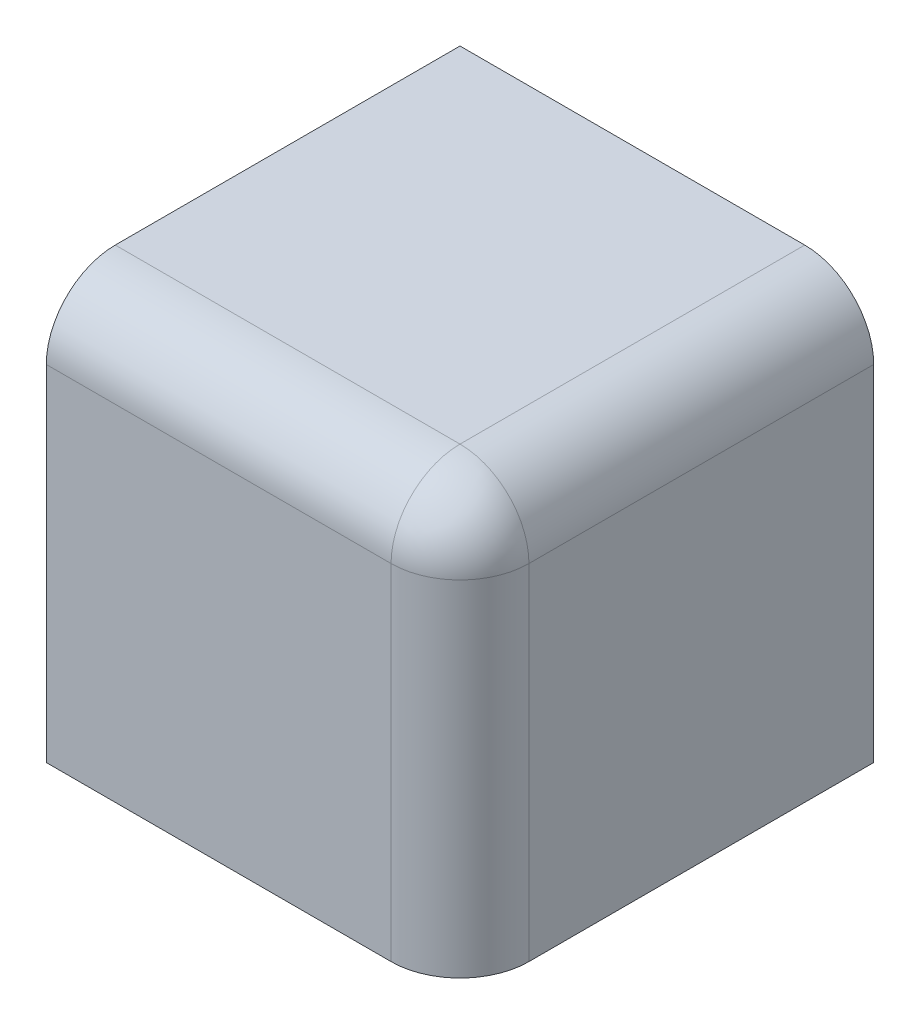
ISO-10303-21;
HEADER;
FILE_DESCRIPTION(('STEP AP214'),'2;1');
FILE_NAME('part.step','',(''),(''),'','','');
FILE_SCHEMA(('AUTOMOTIVE_DESIGN { 1 0 10303 214 1 1 1 1 }'));
ENDSEC;
DATA;
#1=APPLICATION_CONTEXT('core data for automotive mechanical design processes');
#2=APPLICATION_PROTOCOL_DEFINITION('international standard','automotive_design',2000,#1);
#3=PRODUCT_CONTEXT('',#1,'mechanical');
#4=PRODUCT('Part','Part','',(#3));
#5=PRODUCT_RELATED_PRODUCT_CATEGORY('part','',(#4));
#6=PRODUCT_DEFINITION_FORMATION('','',#4);
#7=PRODUCT_DEFINITION_CONTEXT('part definition',#1,'design');
#8=PRODUCT_DEFINITION('design','',#6,#7);
#9=PRODUCT_DEFINITION_SHAPE('','',#8);
#10=(LENGTH_UNIT() NAMED_UNIT(*) SI_UNIT(.MILLI.,.METRE.));
#11=(NAMED_UNIT(*) PLANE_ANGLE_UNIT() SI_UNIT($,.RADIAN.));
#12=(NAMED_UNIT(*) SI_UNIT($,.STERADIAN.) SOLID_ANGLE_UNIT());
#13=UNCERTAINTY_MEASURE_WITH_UNIT(LENGTH_MEASURE(1.E-05),#10,'distance_accuracy_value','');
#14=(GEOMETRIC_REPRESENTATION_CONTEXT(3) GLOBAL_UNCERTAINTY_ASSIGNED_CONTEXT((#13)) GLOBAL_UNIT_ASSIGNED_CONTEXT((#10,
#11,#12)) REPRESENTATION_CONTEXT('',''));
#15=CARTESIAN_POINT('',(0.,0.,0.));
#16=DIRECTION('',(0.,0.,1.));
#17=DIRECTION('',(1.,0.,0.));
#18=AXIS2_PLACEMENT_3D('',#15,#16,#17);
#19=CARTESIAN_POINT('',(76.2,152.4,76.2));
#20=DIRECTION('',(-1.,0.,0.));
#21=DIRECTION('',(0.,0.,1.));
#22=AXIS2_PLACEMENT_3D('',#19,#20,#21);
#23=PLANE('',#22);
#24=DIRECTION('',(0.,0.,-1.));
#25=VECTOR('',#24,1.);
#26=CARTESIAN_POINT('',(76.2,127.,76.2));
#27=LINE('',#26,#25);
#28=CARTESIAN_POINT('',(76.2,127.,-76.2));
#29=VERTEX_POINT('',#28);
#30=CARTESIAN_POINT('',(76.2,127.,50.8));
#31=VERTEX_POINT('',#30);
#32=EDGE_CURVE('E122',#29,#31,#27,.F.);
#33=ORIENTED_EDGE('',*,*,#32,.T.);
#34=DIRECTION('',(0.,-1.,0.));
#35=VECTOR('',#34,1.);
#36=CARTESIAN_POINT('',(76.2,152.4,50.8));
#37=LINE('',#36,#35);
#38=CARTESIAN_POINT('',(76.2,0.,50.8));
#39=VERTEX_POINT('',#38);
#40=EDGE_CURVE('E124',#31,#39,#37,.T.);
#41=ORIENTED_EDGE('',*,*,#40,.T.);
#42=DIRECTION('',(0.,0.,-1.));
#43=VECTOR('',#42,1.);
#44=CARTESIAN_POINT('',(76.2,0.,76.2));
#45=LINE('',#44,#43);
#46=CARTESIAN_POINT('',(76.2,0.,-76.2));
#47=VERTEX_POINT('',#46);
#48=EDGE_CURVE('E113',#39,#47,#45,.T.);
#49=ORIENTED_EDGE('',*,*,#48,.T.);
#50=DIRECTION('',(0.,-1.,0.));
#51=VECTOR('',#50,1.);
#52=CARTESIAN_POINT('',(76.2,152.4,-76.2));
#53=LINE('',#52,#51);
#54=EDGE_CURVE('E106',#29,#47,#53,.T.);
#55=ORIENTED_EDGE('',*,*,#54,.F.);
#56=EDGE_LOOP('',(#33,#41,#49,#55));
#57=FACE_BOUND('',#56,.T.);
#58=ADVANCED_FACE('F34',(#57),#23,.F.);
#59=CARTESIAN_POINT('',(-76.2,152.4,-76.2));
#60=DIRECTION('',(0.,0.,1.));
#61=DIRECTION('',(1.,0.,0.));
#62=AXIS2_PLACEMENT_3D('',#59,#60,#61);
#63=PLANE('',#62);
#64=DIRECTION('',(-1.,0.,0.));
#65=VECTOR('',#64,1.);
#66=CARTESIAN_POINT('',(-76.2,152.4,-76.2));
#67=LINE('',#66,#65);
#68=CARTESIAN_POINT('',(50.7999999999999,152.4,-76.2));
#69=VERTEX_POINT('',#68);
#70=CARTESIAN_POINT('',(-76.2,152.4,-76.2));
#71=VERTEX_POINT('',#70);
#72=EDGE_CURVE('E90',#69,#71,#67,.T.);
#73=ORIENTED_EDGE('',*,*,#72,.F.);
#74=CARTESIAN_POINT('',(50.8,127.,-76.2));
#75=DIRECTION('',(0.,0.,1.));
#76=DIRECTION('',(1.,0.,0.));
#77=AXIS2_PLACEMENT_3D('',#74,#75,#76);
#78=CIRCLE('',#77,25.4);
#79=EDGE_CURVE('E43',#69,#29,#78,.F.);
#80=ORIENTED_EDGE('',*,*,#79,.T.);
#81=ORIENTED_EDGE('',*,*,#54,.T.);
#82=DIRECTION('',(-1.,0.,0.));
#83=VECTOR('',#82,1.);
#84=CARTESIAN_POINT('',(-76.2,0.,-76.2));
#85=LINE('',#84,#83);
#86=CARTESIAN_POINT('',(-76.2,0.,-76.2));
#87=VERTEX_POINT('',#86);
#88=EDGE_CURVE('E103',#47,#87,#85,.T.);
#89=ORIENTED_EDGE('',*,*,#88,.T.);
#90=DIRECTION('',(0.,-1.,0.));
#91=VECTOR('',#90,1.);
#92=CARTESIAN_POINT('',(-76.2,152.4,-76.2));
#93=LINE('',#92,#91);
#94=EDGE_CURVE('E100',#71,#87,#93,.T.);
#95=ORIENTED_EDGE('',*,*,#94,.F.);
#96=EDGE_LOOP('',(#73,#80,#81,#89,#95));
#97=FACE_BOUND('',#96,.T.);
#98=ADVANCED_FACE('F101',(#97),#63,.F.);
#99=CARTESIAN_POINT('',(-76.2,152.4,76.2));
#100=DIRECTION('',(1.,0.,0.));
#101=DIRECTION('',(0.,0.,-1.));
#102=AXIS2_PLACEMENT_3D('',#99,#100,#101);
#103=PLANE('',#102);
#104=DIRECTION('',(0.,-1.,0.));
#105=VECTOR('',#104,1.);
#106=CARTESIAN_POINT('',(-76.2,152.4,76.2));
#107=LINE('',#106,#105);
#108=CARTESIAN_POINT('',(-76.2,127.,76.2));
#109=VERTEX_POINT('',#108);
#110=CARTESIAN_POINT('',(-76.2,0.,76.2));
#111=VERTEX_POINT('',#110);
#112=EDGE_CURVE('E107',#109,#111,#107,.T.);
#113=ORIENTED_EDGE('',*,*,#112,.F.);
#114=CARTESIAN_POINT('',(-76.2,127.,50.8));
#115=DIRECTION('',(1.,0.,0.));
#116=DIRECTION('',(0.,0.,-1.));
#117=AXIS2_PLACEMENT_3D('',#114,#115,#116);
#118=CIRCLE('',#117,25.4);
#119=CARTESIAN_POINT('',(-76.2,152.4,50.8));
#120=VERTEX_POINT('',#119);
#121=EDGE_CURVE('E11',#109,#120,#118,.F.);
#122=ORIENTED_EDGE('',*,*,#121,.T.);
#123=DIRECTION('',(0.,0.,1.));
#124=VECTOR('',#123,1.);
#125=CARTESIAN_POINT('',(-76.2,152.4,76.2));
#126=LINE('',#125,#124);
#127=EDGE_CURVE('E93',#71,#120,#126,.T.);
#128=ORIENTED_EDGE('',*,*,#127,.F.);
#129=ORIENTED_EDGE('',*,*,#94,.T.);
#130=DIRECTION('',(0.,0.,1.));
#131=VECTOR('',#130,1.);
#132=CARTESIAN_POINT('',(-76.2,0.,76.2));
#133=LINE('',#132,#131);
#134=EDGE_CURVE('E117',#87,#111,#133,.T.);
#135=ORIENTED_EDGE('',*,*,#134,.T.);
#136=EDGE_LOOP('',(#113,#122,#128,#129,#135));
#137=FACE_BOUND('',#136,.T.);
#138=ADVANCED_FACE('F109',(#137),#103,.F.);
#139=CARTESIAN_POINT('',(-76.2,152.4,76.2));
#140=DIRECTION('',(0.,0.,-1.));
#141=DIRECTION('',(-1.,0.,0.));
#142=AXIS2_PLACEMENT_3D('',#139,#140,#141);
#143=PLANE('',#142);
#144=DIRECTION('',(1.,0.,0.));
#145=VECTOR('',#144,1.);
#146=CARTESIAN_POINT('',(-76.2,0.,76.2));
#147=LINE('',#146,#145);
#148=CARTESIAN_POINT('',(50.7999999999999,0.,76.2));
#149=VERTEX_POINT('',#148);
#150=EDGE_CURVE('E97',#111,#149,#147,.T.);
#151=ORIENTED_EDGE('',*,*,#150,.T.);
#152=DIRECTION('',(0.,-1.,0.));
#153=VECTOR('',#152,1.);
#154=CARTESIAN_POINT('',(50.8,152.4,76.2));
#155=LINE('',#154,#153);
#156=CARTESIAN_POINT('',(50.8,127.,76.2));
#157=VERTEX_POINT('',#156);
#158=EDGE_CURVE('E131',#149,#157,#155,.F.);
#159=ORIENTED_EDGE('',*,*,#158,.T.);
#160=DIRECTION('',(1.,0.,0.));
#161=VECTOR('',#160,1.);
#162=CARTESIAN_POINT('',(-76.2,127.,76.2));
#163=LINE('',#162,#161);
#164=EDGE_CURVE('E129',#157,#109,#163,.F.);
#165=ORIENTED_EDGE('',*,*,#164,.T.);
#166=ORIENTED_EDGE('',*,*,#112,.T.);
#167=EDGE_LOOP('',(#151,#159,#165,#166));
#168=FACE_BOUND('',#167,.T.);
#169=ADVANCED_FACE('F160',(#168),#143,.F.);
#170=CARTESIAN_POINT('',(0.,152.4,0.));
#171=DIRECTION('',(0.,-1.,0.));
#172=DIRECTION('',(0.,0.,-1.));
#173=AXIS2_PLACEMENT_3D('',#170,#171,#172);
#174=PLANE('',#173);
#175=DIRECTION('',(1.,0.,0.));
#176=VECTOR('',#175,1.);
#177=CARTESIAN_POINT('',(0.,152.4,50.8));
#178=LINE('',#177,#176);
#179=CARTESIAN_POINT('',(50.8,152.4,50.8));
#180=VERTEX_POINT('',#179);
#181=EDGE_CURVE('E51',#120,#180,#178,.T.);
#182=ORIENTED_EDGE('',*,*,#181,.T.);
#183=DIRECTION('',(0.,0.,-1.));
#184=VECTOR('',#183,1.);
#185=CARTESIAN_POINT('',(50.8,152.4,0.));
#186=LINE('',#185,#184);
#187=EDGE_CURVE('E94',#180,#69,#186,.T.);
#188=ORIENTED_EDGE('',*,*,#187,.T.);
#189=ORIENTED_EDGE('',*,*,#72,.T.);
#190=ORIENTED_EDGE('',*,*,#127,.T.);
#191=EDGE_LOOP('',(#182,#188,#189,#190));
#192=FACE_BOUND('',#191,.T.);
#193=ADVANCED_FACE('F92',(#192),#174,.F.);
#194=CARTESIAN_POINT('',(0.,0.,0.));
#195=DIRECTION('',(0.,-1.,0.));
#196=DIRECTION('',(0.,0.,-1.));
#197=AXIS2_PLACEMENT_3D('',#194,#195,#196);
#198=PLANE('',#197);
#199=ORIENTED_EDGE('',*,*,#48,.F.);
#200=CARTESIAN_POINT('',(50.8,0.,50.8));
#201=DIRECTION('',(0.,-1.,0.));
#202=DIRECTION('',(0.,0.,-1.));
#203=AXIS2_PLACEMENT_3D('',#200,#201,#202);
#204=CIRCLE('',#203,25.4);
#205=EDGE_CURVE('E127',#39,#149,#204,.T.);
#206=ORIENTED_EDGE('',*,*,#205,.T.);
#207=ORIENTED_EDGE('',*,*,#150,.F.);
#208=ORIENTED_EDGE('',*,*,#134,.F.);
#209=ORIENTED_EDGE('',*,*,#88,.F.);
#210=EDGE_LOOP('',(#199,#206,#207,#208,#209));
#211=FACE_BOUND('',#210,.T.);
#212=ADVANCED_FACE('F157',(#211),#198,.T.);
#213=CARTESIAN_POINT('',(0.,127.,50.8));
#214=DIRECTION('',(1.,0.,0.));
#215=DIRECTION('',(0.,0.,-1.));
#216=AXIS2_PLACEMENT_3D('',#213,#214,#215);
#217=CYLINDRICAL_SURFACE('',#216,25.4);
#218=ORIENTED_EDGE('',*,*,#121,.F.);
#219=ORIENTED_EDGE('',*,*,#164,.F.);
#220=CARTESIAN_POINT('',(50.8,127.,50.8));
#221=DIRECTION('',(1.,0.,0.));
#222=DIRECTION('',(0.,0.,-1.));
#223=AXIS2_PLACEMENT_3D('',#220,#221,#222);
#224=CIRCLE('',#223,25.4);
#225=EDGE_CURVE('E38',#180,#157,#224,.T.);
#226=ORIENTED_EDGE('',*,*,#225,.F.);
#227=ORIENTED_EDGE('',*,*,#181,.F.);
#228=EDGE_LOOP('',(#218,#219,#226,#227));
#229=FACE_BOUND('',#228,.T.);
#230=ADVANCED_FACE('F36',(#229),#217,.T.);
#231=CARTESIAN_POINT('',(50.8,127.,0.));
#232=DIRECTION('',(0.,0.,-1.));
#233=DIRECTION('',(-1.,0.,0.));
#234=AXIS2_PLACEMENT_3D('',#231,#232,#233);
#235=CYLINDRICAL_SURFACE('',#234,25.4);
#236=ORIENTED_EDGE('',*,*,#79,.F.);
#237=ORIENTED_EDGE('',*,*,#187,.F.);
#238=CARTESIAN_POINT('',(50.8,127.,50.8));
#239=DIRECTION('',(0.,0.,1.));
#240=DIRECTION('',(1.,0.,0.));
#241=AXIS2_PLACEMENT_3D('',#238,#239,#240);
#242=CIRCLE('',#241,25.4);
#243=EDGE_CURVE('E138',#31,#180,#242,.T.);
#244=ORIENTED_EDGE('',*,*,#243,.F.);
#245=ORIENTED_EDGE('',*,*,#32,.F.);
#246=EDGE_LOOP('',(#236,#237,#244,#245));
#247=FACE_BOUND('',#246,.T.);
#248=ADVANCED_FACE('F180',(#247),#235,.T.);
#249=CARTESIAN_POINT('',(50.8,127.,50.8));
#250=DIRECTION('',(0.,0.,1.));
#251=DIRECTION('',(1.,0.,0.));
#252=AXIS2_PLACEMENT_3D('',#249,#250,#251);
#253=SPHERICAL_SURFACE('',#252,25.4);
#254=ORIENTED_EDGE('',*,*,#243,.T.);
#255=ORIENTED_EDGE('',*,*,#225,.T.);
#256=CARTESIAN_POINT('',(50.8,127.,50.8));
#257=DIRECTION('',(0.,1.,0.));
#258=DIRECTION('',(0.,0.,1.));
#259=AXIS2_PLACEMENT_3D('',#256,#257,#258);
#260=CIRCLE('',#259,25.4);
#261=EDGE_CURVE('E136',#31,#157,#260,.F.);
#262=ORIENTED_EDGE('',*,*,#261,.F.);
#263=EDGE_LOOP('',(#254,#255,#262));
#264=FACE_BOUND('',#263,.T.);
#265=ADVANCED_FACE('F145',(#264),#253,.T.);
#266=CARTESIAN_POINT('',(50.8,152.4,50.8));
#267=DIRECTION('',(0.,-1.,0.));
#268=DIRECTION('',(0.,0.,-1.));
#269=AXIS2_PLACEMENT_3D('',#266,#267,#268);
#270=CYLINDRICAL_SURFACE('',#269,25.4);
#271=ORIENTED_EDGE('',*,*,#261,.T.);
#272=ORIENTED_EDGE('',*,*,#158,.F.);
#273=ORIENTED_EDGE('',*,*,#205,.F.);
#274=ORIENTED_EDGE('',*,*,#40,.F.);
#275=EDGE_LOOP('',(#271,#272,#273,#274));
#276=FACE_BOUND('',#275,.T.);
#277=ADVANCED_FACE('F151',(#276),#270,.T.);
#278=CLOSED_SHELL('',(#58,#98,#138,#169,#193,#212,#230,#248,#265,#277));
#279=MANIFOLD_SOLID_BREP('B2',#278);
#280=ADVANCED_BREP_SHAPE_REPRESENTATION('',(#18,#279),#14);
#281=SHAPE_DEFINITION_REPRESENTATION(#9,#280);
ENDSEC;
END-ISO-10303-21;
